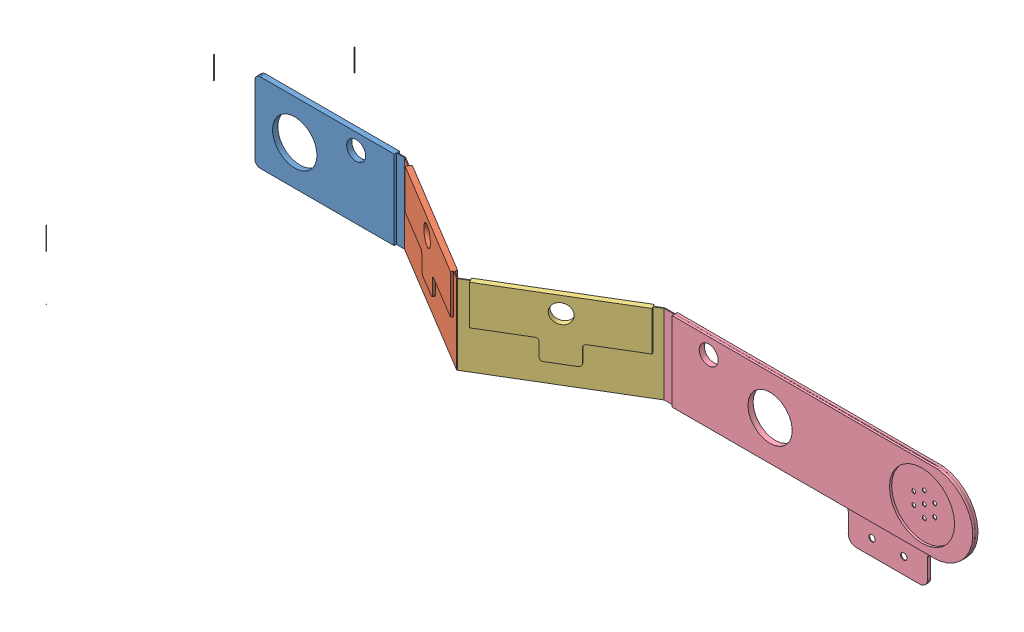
SolidWorks assembly d1102368 beam diverter PCB model BENT.SLDASM, configuration Simplified (file format 12000). Lengths in mm.
Overall size (121.91 17.81 50.17).
4 component instances, 4 part files, 6 mates.
Components (placement in the parent):
- d1102368 beam diverter PCB model FLEX1-1: d1102368 beam diverter PCB model FLEX1.SLDPRT [Default] at origin
- d1102368 beam diverter PCB model FLEX2-2: d1102368 beam diverter PCB model FLEX2.SLDPRT [Simplified] at (25.7814 0.0016 -92.1824) x (0.857167 0 0.515038) z (-0.515038 0 0.857167) size (48.01 12.71 0.84)
- d1102368 beam diverter PCB model FLEX3-1: d1102368 beam diverter PCB model FLEX3.SLDPRT [Simplified] at (25.5093 0.004 117.4116) x (0.857167 0 -0.515038) z (0.515038 0 0.857167) size (72.14 12.71 0.84)
- d1102368 beam diverter PCB model FLEX4-1: d1102368 beam diverter PCB model FLEX4.SLDPRT [Simplified] at (-6.7986 0.0041 0.1308) size (121.91 17.8 0.84)
Mates (geometry in assembly coordinates):
- Coincident2: coincident aligned: line of d1102368 beam diverter PCB model FLEX1-1 through (179.0903 251.4779 0.3912) axis (0 1 0); line of d1102368 beam diverter PCB model FLEX2-2 through (179.0903 251.4796 0.3912) axis (0 1 0)
- Angle1: planar angle = 0.541052 rad aligned: line of d1102368 beam diverter PCB model FLEX1-1 through (179.0903 264.1854 0.2642) axis (-1 0.000001 0); line of d1102368 beam diverter PCB model FLEX2-2 through (180.6144 264.187 1.1588) axis (-0.857167 0.000001 -0.515038)
- Coincident9: coincident anti-aligned: line of d1102368 beam diverter PCB model FLEX2-2 through (200.0569 264.187 12.841) axis (0 -1 0); line of d1102368 beam diverter PCB model FLEX3-1 through (200.0569 251.4819 12.841) axis (0 1 0)
- Angle3: planar angle = 1.082104 rad aligned: line of d1102368 beam diverter PCB model FLEX2-2 through (200.0569 264.187 12.841) axis (-0.857167 0 -0.515038); line of d1102368 beam diverter PCB model FLEX3-1 through (201.3632 264.1894 12.0561) axis (-0.857167 0 0.515038)
- Coincident11: coincident anti-aligned: line of d1102368 beam diverter PCB model FLEX3-1 through (220.8057 264.1894 0.522) axis (0 -1 0); line of d1102368 beam diverter PCB model FLEX4-1 through (220.8057 251.4821 0.522) axis (0 1 0)
- Angle4: planar angle = 0.541052 rad aligned: line of d1102368 beam diverter PCB model FLEX3-1 through (220.8057 264.1894 0.522) axis (-0.857167 0 0.515038); line of d1102368 beam diverter PCB model FLEX4-1 through (264.2194 264.1895 0.522) axis (-1 0 0)
